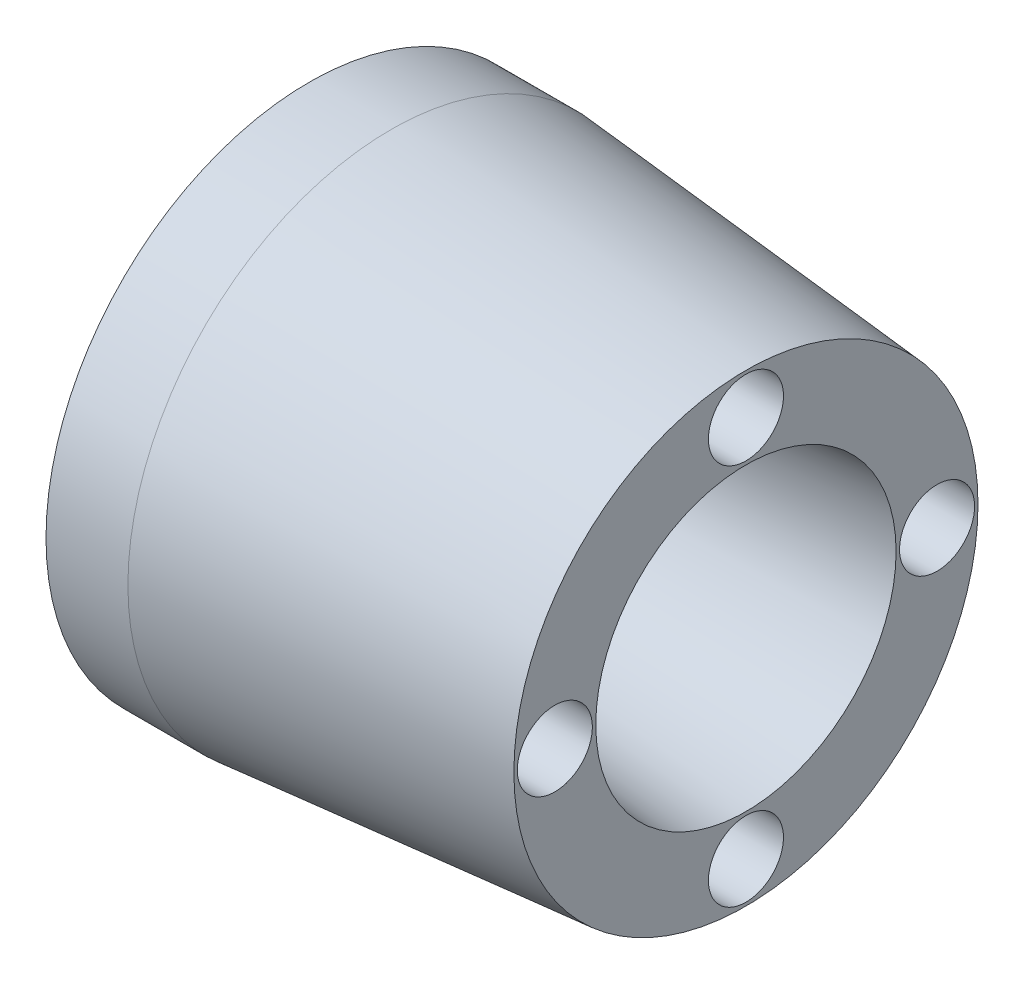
ISO-10303-21;
HEADER;
FILE_DESCRIPTION(('STEP AP214'),'2;1');
FILE_NAME('part.step','',(''),(''),'','','');
FILE_SCHEMA(('AUTOMOTIVE_DESIGN { 1 0 10303 214 1 1 1 1 }'));
ENDSEC;
DATA;
#1=APPLICATION_CONTEXT('core data for automotive mechanical design processes');
#2=APPLICATION_PROTOCOL_DEFINITION('international standard','automotive_design',2000,#1);
#3=PRODUCT_CONTEXT('',#1,'mechanical');
#4=PRODUCT('Part','Part','',(#3));
#5=PRODUCT_RELATED_PRODUCT_CATEGORY('part','',(#4));
#6=PRODUCT_DEFINITION_FORMATION('','',#4);
#7=PRODUCT_DEFINITION_CONTEXT('part definition',#1,'design');
#8=PRODUCT_DEFINITION('design','',#6,#7);
#9=PRODUCT_DEFINITION_SHAPE('','',#8);
#10=(LENGTH_UNIT() NAMED_UNIT(*) SI_UNIT(.MILLI.,.METRE.));
#11=(NAMED_UNIT(*) PLANE_ANGLE_UNIT() SI_UNIT($,.RADIAN.));
#12=(NAMED_UNIT(*) SI_UNIT($,.STERADIAN.) SOLID_ANGLE_UNIT());
#13=UNCERTAINTY_MEASURE_WITH_UNIT(LENGTH_MEASURE(1.E-05),#10,'distance_accuracy_value','');
#14=(GEOMETRIC_REPRESENTATION_CONTEXT(3) GLOBAL_UNCERTAINTY_ASSIGNED_CONTEXT((#13)) GLOBAL_UNIT_ASSIGNED_CONTEXT((#10,
#11,#12)) REPRESENTATION_CONTEXT('',''));
#15=CARTESIAN_POINT('',(0.,0.,0.));
#16=DIRECTION('',(0.,0.,1.));
#17=DIRECTION('',(1.,0.,0.));
#18=AXIS2_PLACEMENT_3D('',#15,#16,#17);
#19=CARTESIAN_POINT('',(16.,0.,0.));
#20=DIRECTION('',(-1.,0.,0.));
#21=DIRECTION('',(0.,0.,1.));
#22=AXIS2_PLACEMENT_3D('',#19,#20,#21);
#23=CONICAL_SURFACE('',#22,8.499799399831,0.0872664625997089);
#24=CARTESIAN_POINT('',(3.,0.,0.));
#25=DIRECTION('',(-1.,0.,0.));
#26=DIRECTION('',(0.,0.,1.));
#27=AXIS2_PLACEMENT_3D('',#24,#25,#26);
#28=CIRCLE('',#27,9.63715202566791);
#29=CARTESIAN_POINT('',(3.,0.,9.63715202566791));
#30=VERTEX_POINT('',#29);
#31=EDGE_CURVE('E10',#30,#30,#28,.T.);
#32=ORIENTED_EDGE('',*,*,#31,.F.);
#33=EDGE_LOOP('',(#32));
#34=FACE_BOUND('',#33,.T.);
#35=CARTESIAN_POINT('',(16.,0.,0.));
#36=DIRECTION('',(-1.,0.,0.));
#37=DIRECTION('',(0.,0.,1.));
#38=AXIS2_PLACEMENT_3D('',#35,#36,#37);
#39=CIRCLE('',#38,8.499799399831);
#40=CARTESIAN_POINT('',(16.,0.,8.499799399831));
#41=VERTEX_POINT('',#40);
#42=EDGE_CURVE('E66',#41,#41,#39,.T.);
#43=ORIENTED_EDGE('',*,*,#42,.T.);
#44=EDGE_LOOP('',(#43));
#45=FACE_BOUND('',#44,.T.);
#46=ADVANCED_FACE('F39',(#34,#45),#23,.T.);
#47=CARTESIAN_POINT('',(0.,0.,0.));
#48=DIRECTION('',(-1.,0.,0.));
#49=DIRECTION('',(0.,0.,1.));
#50=AXIS2_PLACEMENT_3D('',#47,#48,#49);
#51=CYLINDRICAL_SURFACE('',#50,9.63715202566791);
#52=CARTESIAN_POINT('',(0.,0.,0.));
#53=DIRECTION('',(-1.,0.,0.));
#54=DIRECTION('',(0.,0.,1.));
#55=AXIS2_PLACEMENT_3D('',#52,#53,#54);
#56=CIRCLE('',#55,9.63715202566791);
#57=CARTESIAN_POINT('',(0.,0.,9.63715202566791));
#58=VERTEX_POINT('',#57);
#59=EDGE_CURVE('E46',#58,#58,#56,.T.);
#60=ORIENTED_EDGE('',*,*,#59,.F.);
#61=EDGE_LOOP('',(#60));
#62=FACE_BOUND('',#61,.T.);
#63=ORIENTED_EDGE('',*,*,#31,.T.);
#64=EDGE_LOOP('',(#63));
#65=FACE_BOUND('',#64,.T.);
#66=ADVANCED_FACE('F141',(#62,#65),#51,.T.);
#67=CARTESIAN_POINT('',(0.,0.,0.));
#68=DIRECTION('',(1.,0.,0.));
#69=DIRECTION('',(0.,0.,-1.));
#70=AXIS2_PLACEMENT_3D('',#67,#68,#69);
#71=PLANE('',#70);
#72=CARTESIAN_POINT('',(0.,0.,0.));
#73=DIRECTION('',(-1.,0.,0.));
#74=DIRECTION('',(0.,0.,1.));
#75=AXIS2_PLACEMENT_3D('',#72,#73,#74);
#76=CIRCLE('',#75,4.36284797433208);
#77=CARTESIAN_POINT('',(0.,0.,4.36284797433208));
#78=VERTEX_POINT('',#77);
#79=EDGE_CURVE('E51',#78,#78,#76,.T.);
#80=ORIENTED_EDGE('',*,*,#79,.F.);
#81=EDGE_LOOP('',(#80));
#82=FACE_BOUND('',#81,.T.);
#83=ORIENTED_EDGE('',*,*,#59,.T.);
#84=EDGE_LOOP('',(#83));
#85=FACE_BOUND('',#84,.T.);
#86=ADVANCED_FACE('F136',(#82,#85),#71,.F.);
#87=CARTESIAN_POINT('',(0.,0.,0.));
#88=DIRECTION('',(-1.,0.,0.));
#89=DIRECTION('',(0.,0.,1.));
#90=AXIS2_PLACEMENT_3D('',#87,#88,#89);
#91=CYLINDRICAL_SURFACE('',#90,4.36284797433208);
#92=CARTESIAN_POINT('',(3.,0.,0.));
#93=DIRECTION('',(-1.,0.,0.));
#94=DIRECTION('',(0.,0.,1.));
#95=AXIS2_PLACEMENT_3D('',#92,#93,#94);
#96=CIRCLE('',#95,4.36284797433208);
#97=CARTESIAN_POINT('',(3.,0.,4.36284797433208));
#98=VERTEX_POINT('',#97);
#99=EDGE_CURVE('E56',#98,#98,#96,.T.);
#100=ORIENTED_EDGE('',*,*,#99,.F.);
#101=EDGE_LOOP('',(#100));
#102=FACE_BOUND('',#101,.T.);
#103=ORIENTED_EDGE('',*,*,#79,.T.);
#104=EDGE_LOOP('',(#103));
#105=FACE_BOUND('',#104,.T.);
#106=ADVANCED_FACE('F130',(#102,#105),#91,.F.);
#107=CARTESIAN_POINT('',(3.,0.,0.));
#108=DIRECTION('',(1.,0.,0.));
#109=DIRECTION('',(0.,0.,-1.));
#110=AXIS2_PLACEMENT_3D('',#107,#108,#109);
#111=CONICAL_SURFACE('',#110,4.36284797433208,0.0872664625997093);
#112=CARTESIAN_POINT('',(16.,0.,0.));
#113=DIRECTION('',(-1.,0.,0.));
#114=DIRECTION('',(0.,0.,1.));
#115=AXIS2_PLACEMENT_3D('',#112,#113,#114);
#116=CIRCLE('',#115,5.500200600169);
#117=CARTESIAN_POINT('',(16.,0.,5.500200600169));
#118=VERTEX_POINT('',#117);
#119=EDGE_CURVE('E62',#118,#118,#116,.T.);
#120=ORIENTED_EDGE('',*,*,#119,.F.);
#121=EDGE_LOOP('',(#120));
#122=FACE_BOUND('',#121,.T.);
#123=ORIENTED_EDGE('',*,*,#99,.T.);
#124=EDGE_LOOP('',(#123));
#125=FACE_BOUND('',#124,.T.);
#126=ADVANCED_FACE('F116',(#122,#125),#111,.F.);
#127=CARTESIAN_POINT('',(16.,0.,0.));
#128=DIRECTION('',(-1.,0.,0.));
#129=DIRECTION('',(0.,0.,1.));
#130=AXIS2_PLACEMENT_3D('',#127,#128,#129);
#131=PLANE('',#130);
#132=CARTESIAN_POINT('',(16.,0.,7.));
#133=DIRECTION('',(1.,0.,0.));
#134=DIRECTION('',(0.,1.,0.));
#135=AXIS2_PLACEMENT_3D('',#132,#133,#134);
#136=CIRCLE('',#135,1.375);
#137=CARTESIAN_POINT('',(16.,1.37499999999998,7.00000000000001));
#138=VERTEX_POINT('',#137);
#139=EDGE_CURVE('E95',#138,#138,#136,.T.);
#140=ORIENTED_EDGE('',*,*,#139,.F.);
#141=EDGE_LOOP('',(#140));
#142=FACE_BOUND('',#141,.T.);
#143=CARTESIAN_POINT('',(16.,-7.,0.));
#144=DIRECTION('',(1.,0.,0.));
#145=DIRECTION('',(0.,0.,1.));
#146=AXIS2_PLACEMENT_3D('',#143,#144,#145);
#147=CIRCLE('',#146,1.375);
#148=CARTESIAN_POINT('',(16.,-7.,1.375));
#149=VERTEX_POINT('',#148);
#150=EDGE_CURVE('E87',#149,#149,#147,.T.);
#151=ORIENTED_EDGE('',*,*,#150,.F.);
#152=EDGE_LOOP('',(#151));
#153=FACE_BOUND('',#152,.T.);
#154=CARTESIAN_POINT('',(16.,0.,-7.));
#155=DIRECTION('',(1.,0.,0.));
#156=DIRECTION('',(0.,-1.,0.));
#157=AXIS2_PLACEMENT_3D('',#154,#155,#156);
#158=CIRCLE('',#157,1.375);
#159=CARTESIAN_POINT('',(16.,-1.37499999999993,-7.00000000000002));
#160=VERTEX_POINT('',#159);
#161=EDGE_CURVE('E79',#160,#160,#158,.T.);
#162=ORIENTED_EDGE('',*,*,#161,.F.);
#163=EDGE_LOOP('',(#162));
#164=FACE_BOUND('',#163,.T.);
#165=CARTESIAN_POINT('',(16.,7.,0.));
#166=DIRECTION('',(1.,0.,0.));
#167=DIRECTION('',(0.,0.,-1.));
#168=AXIS2_PLACEMENT_3D('',#165,#166,#167);
#169=CIRCLE('',#168,1.375);
#170=CARTESIAN_POINT('',(16.,7.,-1.375));
#171=VERTEX_POINT('',#170);
#172=EDGE_CURVE('E71',#171,#171,#169,.T.);
#173=ORIENTED_EDGE('',*,*,#172,.F.);
#174=EDGE_LOOP('',(#173));
#175=FACE_BOUND('',#174,.T.);
#176=ORIENTED_EDGE('',*,*,#42,.F.);
#177=EDGE_LOOP('',(#176));
#178=FACE_BOUND('',#177,.T.);
#179=ORIENTED_EDGE('',*,*,#119,.T.);
#180=EDGE_LOOP('',(#179));
#181=FACE_BOUND('',#180,.T.);
#182=ADVANCED_FACE('F112',(#142,#153,#164,#175,#178,#181),#131,.F.);
#183=CARTESIAN_POINT('',(1.,7.,0.));
#184=DIRECTION('',(1.,0.,0.));
#185=DIRECTION('',(0.,0.,-1.));
#186=AXIS2_PLACEMENT_3D('',#183,#184,#185);
#187=CYLINDRICAL_SURFACE('',#186,1.375);
#188=CARTESIAN_POINT('',(1.,7.,0.));
#189=DIRECTION('',(1.,0.,0.));
#190=DIRECTION('',(0.,0.,-1.));
#191=AXIS2_PLACEMENT_3D('',#188,#189,#190);
#192=CIRCLE('',#191,1.375);
#193=CARTESIAN_POINT('',(1.,7.,-1.375));
#194=VERTEX_POINT('',#193);
#195=EDGE_CURVE('E70',#194,#194,#192,.T.);
#196=ORIENTED_EDGE('',*,*,#195,.F.);
#197=EDGE_LOOP('',(#196));
#198=FACE_BOUND('',#197,.T.);
#199=ORIENTED_EDGE('',*,*,#172,.T.);
#200=EDGE_LOOP('',(#199));
#201=FACE_BOUND('',#200,.T.);
#202=ADVANCED_FACE('F115',(#198,#201),#187,.F.);
#203=CARTESIAN_POINT('',(1.,0.,0.));
#204=DIRECTION('',(1.,0.,0.));
#205=DIRECTION('',(0.,0.,-1.));
#206=AXIS2_PLACEMENT_3D('',#203,#204,#205);
#207=PLANE('',#206);
#208=ORIENTED_EDGE('',*,*,#195,.T.);
#209=EDGE_LOOP('',(#208));
#210=FACE_BOUND('',#209,.T.);
#211=ADVANCED_FACE('F182',(#210),#207,.T.);
#212=CARTESIAN_POINT('',(1.,0.,-7.));
#213=DIRECTION('',(1.,0.,0.));
#214=DIRECTION('',(0.,0.,-1.));
#215=AXIS2_PLACEMENT_3D('',#212,#213,#214);
#216=CYLINDRICAL_SURFACE('',#215,1.375);
#217=CARTESIAN_POINT('',(1.,0.,-7.));
#218=DIRECTION('',(1.,0.,0.));
#219=DIRECTION('',(0.,-1.,0.));
#220=AXIS2_PLACEMENT_3D('',#217,#218,#219);
#221=CIRCLE('',#220,1.375);
#222=CARTESIAN_POINT('',(1.,-1.37499999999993,-7.00000000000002));
#223=VERTEX_POINT('',#222);
#224=EDGE_CURVE('E83',#223,#223,#221,.T.);
#225=ORIENTED_EDGE('',*,*,#224,.F.);
#226=EDGE_LOOP('',(#225));
#227=FACE_BOUND('',#226,.T.);
#228=ORIENTED_EDGE('',*,*,#161,.T.);
#229=EDGE_LOOP('',(#228));
#230=FACE_BOUND('',#229,.T.);
#231=ADVANCED_FACE('F193',(#227,#230),#216,.F.);
#232=CARTESIAN_POINT('',(1.,0.,0.));
#233=DIRECTION('',(1.,0.,0.));
#234=DIRECTION('',(0.,-1.,0.));
#235=AXIS2_PLACEMENT_3D('',#232,#233,#234);
#236=PLANE('',#235);
#237=ORIENTED_EDGE('',*,*,#224,.T.);
#238=EDGE_LOOP('',(#237));
#239=FACE_BOUND('',#238,.T.);
#240=ADVANCED_FACE('F208',(#239),#236,.T.);
#241=CARTESIAN_POINT('',(1.,-7.,0.));
#242=DIRECTION('',(1.,0.,0.));
#243=DIRECTION('',(0.,0.,-1.));
#244=AXIS2_PLACEMENT_3D('',#241,#242,#243);
#245=CYLINDRICAL_SURFACE('',#244,1.375);
#246=CARTESIAN_POINT('',(1.,-7.,0.));
#247=DIRECTION('',(1.,0.,0.));
#248=DIRECTION('',(0.,0.,1.));
#249=AXIS2_PLACEMENT_3D('',#246,#247,#248);
#250=CIRCLE('',#249,1.375);
#251=CARTESIAN_POINT('',(1.,-7.,1.375));
#252=VERTEX_POINT('',#251);
#253=EDGE_CURVE('E91',#252,#252,#250,.T.);
#254=ORIENTED_EDGE('',*,*,#253,.F.);
#255=EDGE_LOOP('',(#254));
#256=FACE_BOUND('',#255,.T.);
#257=ORIENTED_EDGE('',*,*,#150,.T.);
#258=EDGE_LOOP('',(#257));
#259=FACE_BOUND('',#258,.T.);
#260=ADVANCED_FACE('F219',(#256,#259),#245,.F.);
#261=CARTESIAN_POINT('',(1.,0.,0.));
#262=DIRECTION('',(1.,0.,0.));
#263=DIRECTION('',(0.,0.,1.));
#264=AXIS2_PLACEMENT_3D('',#261,#262,#263);
#265=PLANE('',#264);
#266=ORIENTED_EDGE('',*,*,#253,.T.);
#267=EDGE_LOOP('',(#266));
#268=FACE_BOUND('',#267,.T.);
#269=ADVANCED_FACE('F108',(#268),#265,.T.);
#270=CARTESIAN_POINT('',(1.,0.,7.));
#271=DIRECTION('',(1.,0.,0.));
#272=DIRECTION('',(0.,0.,-1.));
#273=AXIS2_PLACEMENT_3D('',#270,#271,#272);
#274=CYLINDRICAL_SURFACE('',#273,1.375);
#275=CARTESIAN_POINT('',(1.,0.,7.));
#276=DIRECTION('',(1.,0.,0.));
#277=DIRECTION('',(0.,1.,0.));
#278=AXIS2_PLACEMENT_3D('',#275,#276,#277);
#279=CIRCLE('',#278,1.375);
#280=CARTESIAN_POINT('',(1.,1.37499999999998,7.00000000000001));
#281=VERTEX_POINT('',#280);
#282=EDGE_CURVE('E75',#281,#281,#279,.T.);
#283=ORIENTED_EDGE('',*,*,#282,.F.);
#284=EDGE_LOOP('',(#283));
#285=FACE_BOUND('',#284,.T.);
#286=ORIENTED_EDGE('',*,*,#139,.T.);
#287=EDGE_LOOP('',(#286));
#288=FACE_BOUND('',#287,.T.);
#289=ADVANCED_FACE('F105',(#285,#288),#274,.F.);
#290=CARTESIAN_POINT('',(1.,0.,0.));
#291=DIRECTION('',(1.,0.,0.));
#292=DIRECTION('',(0.,1.,0.));
#293=AXIS2_PLACEMENT_3D('',#290,#291,#292);
#294=PLANE('',#293);
#295=ORIENTED_EDGE('',*,*,#282,.T.);
#296=EDGE_LOOP('',(#295));
#297=FACE_BOUND('',#296,.T.);
#298=ADVANCED_FACE('F103',(#297),#294,.T.);
#299=CLOSED_SHELL('',(#46,#66,#86,#106,#126,#182,#202,#211,#231,#240,#260,#269,#289,#298));
#300=MANIFOLD_SOLID_BREP('B2',#299);
#301=ADVANCED_BREP_SHAPE_REPRESENTATION('',(#18,#300),#14);
#302=SHAPE_DEFINITION_REPRESENTATION(#9,#301);
ENDSEC;
END-ISO-10303-21;
